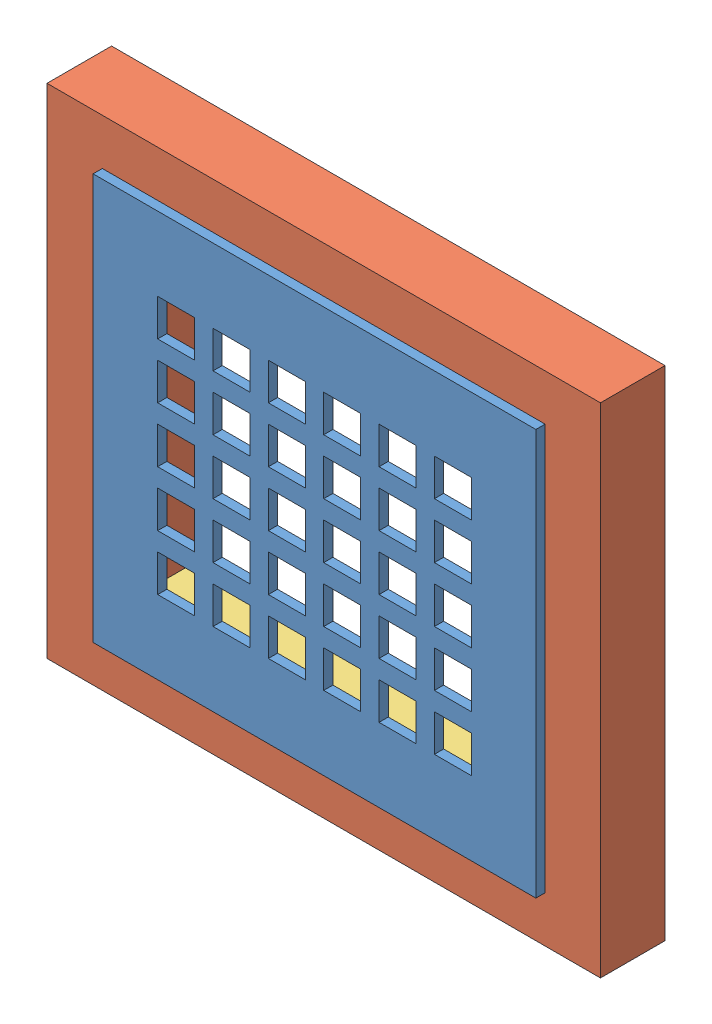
SolidWorks assembly 607.SLDASM, configuration Default (file format 11000). Lengths in mm.
Overall size (190.5 171.45 25.4).
4 component instances, 3 part files, 7 mates.
Components (placement in the parent):
- 208 Lattice Perforated Grille(3_8 HS)-1: 208 Lattice Perforated Grille(3_8 HS).SLDPRT [Default] at origin size (152.4 139.7 3.17)
- Opening (Wall_Floor_Ceiling)-1: Opening (Wall_Floor_Ceiling).SLDPRT [Default] at (0 0 -22.225) size (190.5 171.45 22.23)
- Stiffener Bar (Provided)-1: Stiffener Bar (Provided).SLDPRT [Default] at (0 -47.625 0) x (0 1 0) z (1 0 0) size (3.17 19.05 114.3)
- Stiffener Bar (Provided)-2: Stiffener Bar (Provided).SLDPRT [Default] at (0 47.625 0) x (0 -1 0) z (-1 0 0) size (3.17 19.05 114.3)
Mates (geometry in assembly coordinates):
- Coincident1: coincident: plane of 208 Lattice Perforated Grille(3_8 HS)-1 through (0 0 0) normal (0 0 -1); plane of ? through (18.5422 0 0) normal (0 0 1)
- Coincident5: coincident: plane of assembly; plane of assembly; plane of 208 Lattice Perforated Grille(3_8 HS)-1 through (0 0 0) normal (0 0 -1); plane of Stiffener Bar (Provided)-1 through (57.15 -47.625 0) normal (0 0 1)
- Coincident10: coincident: plane of assembly; plane of assembly; plane of 208 Lattice Perforated Grille(3_8 HS)-1 through (41.275 44.45 0) normal (0 -1 0); plane of Stiffener Bar (Provided)-2 through (-57.15 44.45 0) normal (0 -1 0)
- Coincident11: coincident: plane of assembly; plane of assembly; plane of 208 Lattice Perforated Grille(3_8 HS)-1 through (41.275 -44.45 0) normal (0 1 0); plane of Stiffener Bar (Provided)-1 through (57.15 -44.45 0) normal (0 1 0)
- Distance2: distance = 19.05 mm: plane of assembly; plane of assembly; plane of Stiffener Bar (Provided)-2 through (57.15 47.625 0) normal (1 0 0); plane of 208 Lattice Perforated Grille(3_8 HS)-1 through (76.2 69.85 3.175) normal (1 0 0)
- Coincident13: coincident: plane of ? through (-38.6078 47.625 0) normal (0 -1 0); plane of Stiffener Bar (Provided)-2 through (-57.15 47.625 0) normal (0 1 0)
- Coincident14: coincident: plane of assembly; plane of assembly; plane of Opening (Wall_Floor_Ceiling)-1 through (57.15 47.625 0) normal (-1 0 0); plane of Stiffener Bar (Provided)-2 through (57.15 47.625 0) normal (1 0 0)
